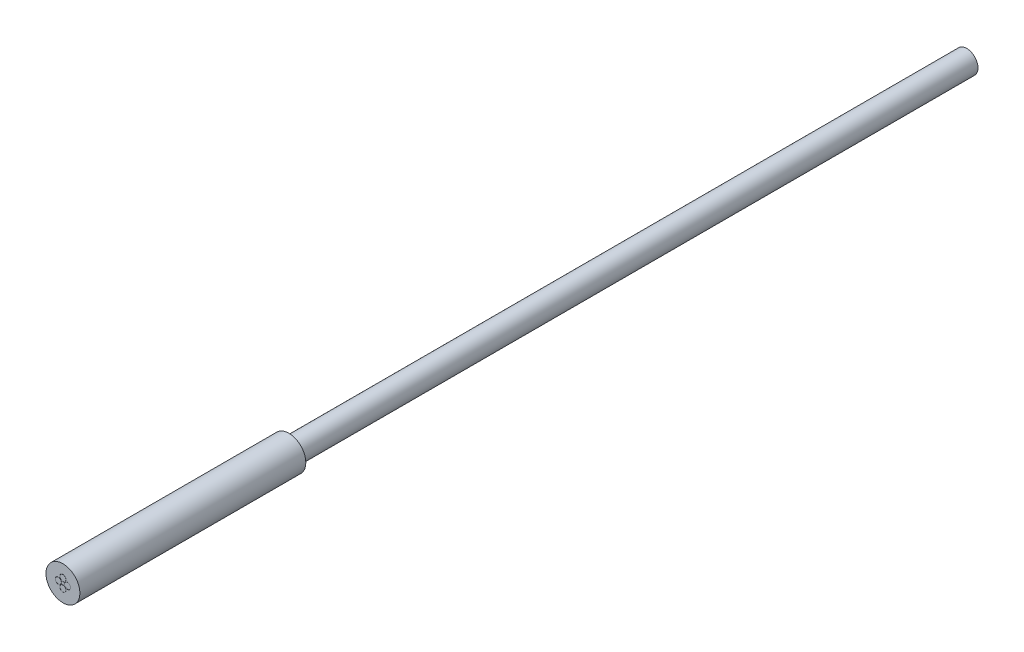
from build123d import *

# Parameters (mm, degrees)
SKETCH_1_R          = 0.75
EXTRUDE_1_DEPTH     = 10
SKETCH_2_R          = 0.5
EXTRUDE_2_DEPTH     = 30
SKETCH_3_R          = 0.1375
SKETCH_3_R_2        = 0.1325
CUT_EXTRUDE_1_DEPTH = 0.1


with BuildPart() as part:
    # Sketch 1 → Extrude 1 (new body)
    with BuildSketch(Plane.XY):
        Circle(SKETCH_1_R)
    extrude(amount=-EXTRUDE_1_DEPTH)

    # Sketch 2 → Extrude 2 (add)
    with BuildSketch(Plane(origin=(0, 0, -10), x_dir=(-1, 0, 0), z_dir=(0, 0, -1))):
        Circle(SKETCH_2_R)
    extrude(amount=EXTRUDE_2_DEPTH)

    # Sketch 3 → Cut-Extrude 1 (cut)
    # profile 1 of 4: a face of its own
    with BuildSketch(Plane.XY):
        with Locations((0, 0.201525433)):
            Circle(SKETCH_3_R)
        with Locations((0, 0.201525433)):
            Circle(SKETCH_3_R_2, mode=Mode.SUBTRACT)
    # profile 2 of 4: a face of its own
    with BuildSketch(Plane.XY):
        with Locations((0.201525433, 0)):
            Circle(SKETCH_3_R)
        with Locations((0.201525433, 0)):
            Circle(SKETCH_3_R_2, mode=Mode.SUBTRACT)
    # profile 3 of 4: a face of its own
    with BuildSketch(Plane.XY):
        with Locations((0, -0.201525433)):
            Circle(SKETCH_3_R)
        with Locations((0, -0.201525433)):
            Circle(SKETCH_3_R_2, mode=Mode.SUBTRACT)
    # profile 4 of 4: a face of its own
    with BuildSketch(Plane.XY):
        with Locations((-0.201525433, 0)):
            Circle(SKETCH_3_R)
        with Locations((-0.201525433, 0)):
            Circle(SKETCH_3_R_2, mode=Mode.SUBTRACT)
    extrude(amount=-CUT_EXTRUDE_1_DEPTH, mode=Mode.SUBTRACT)


solid = part.part
